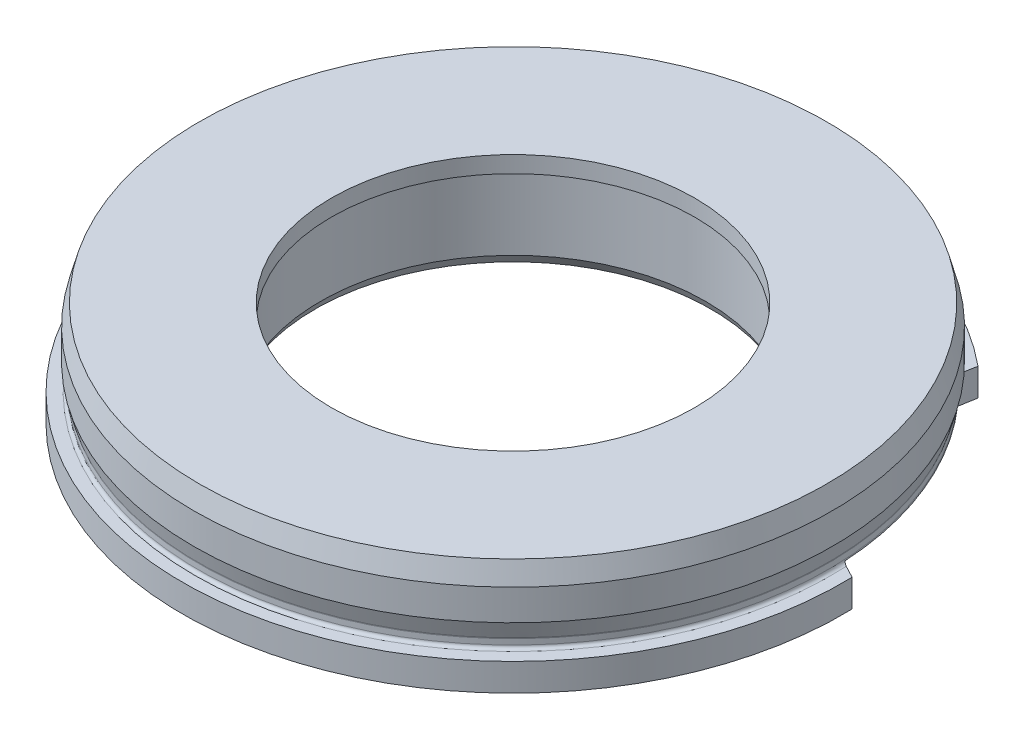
ISO-10303-21;
HEADER;
FILE_DESCRIPTION(('STEP AP214'),'2;1');
FILE_NAME('part.step','',(''),(''),'','','');
FILE_SCHEMA(('AUTOMOTIVE_DESIGN { 1 0 10303 214 1 1 1 1 }'));
ENDSEC;
DATA;
#1=APPLICATION_CONTEXT('core data for automotive mechanical design processes');
#2=APPLICATION_PROTOCOL_DEFINITION('international standard','automotive_design',2000,#1);
#3=PRODUCT_CONTEXT('',#1,'mechanical');
#4=PRODUCT('Part','Part','',(#3));
#5=PRODUCT_RELATED_PRODUCT_CATEGORY('part','',(#4));
#6=PRODUCT_DEFINITION_FORMATION('','',#4);
#7=PRODUCT_DEFINITION_CONTEXT('part definition',#1,'design');
#8=PRODUCT_DEFINITION('design','',#6,#7);
#9=PRODUCT_DEFINITION_SHAPE('','',#8);
#10=(LENGTH_UNIT() NAMED_UNIT(*) SI_UNIT(.MILLI.,.METRE.));
#11=(NAMED_UNIT(*) PLANE_ANGLE_UNIT() SI_UNIT($,.RADIAN.));
#12=(NAMED_UNIT(*) SI_UNIT($,.STERADIAN.) SOLID_ANGLE_UNIT());
#13=UNCERTAINTY_MEASURE_WITH_UNIT(LENGTH_MEASURE(1.E-05),#10,'distance_accuracy_value','');
#14=(GEOMETRIC_REPRESENTATION_CONTEXT(3) GLOBAL_UNCERTAINTY_ASSIGNED_CONTEXT((#13)) GLOBAL_UNIT_ASSIGNED_CONTEXT((#10,
#11,#12)) REPRESENTATION_CONTEXT('',''));
#15=CARTESIAN_POINT('',(0.,0.,0.));
#16=DIRECTION('',(0.,0.,1.));
#17=DIRECTION('',(1.,0.,0.));
#18=AXIS2_PLACEMENT_3D('',#15,#16,#17);
#19=CARTESIAN_POINT('',(0.,0.,0.));
#20=DIRECTION('',(0.,1.,0.));
#21=DIRECTION('',(0.,0.,1.));
#22=AXIS2_PLACEMENT_3D('',#19,#20,#21);
#23=PLANE('',#22);
#24=CARTESIAN_POINT('',(38.6481439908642,0.,-18.8499593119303));
#25=DIRECTION('',(0.,1.,0.));
#26=DIRECTION('',(1.,0.,0.));
#27=AXIS2_PLACEMENT_3D('',#24,#25,#26);
#28=CIRCLE('',#27,20.);
#29=CARTESIAN_POINT('',(28.8657979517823,0.,-1.4055990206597));
#30=VERTEX_POINT('',#29);
#31=CARTESIAN_POINT('',(29.9887421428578,0.,-0.821793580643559));
#32=VERTEX_POINT('',#31);
#33=EDGE_CURVE('E86',#30,#32,#28,.T.);
#34=ORIENTED_EDGE('',*,*,#33,.F.);
#35=CARTESIAN_POINT('',(0.,0.,0.));
#36=DIRECTION('',(0.,-1.,0.));
#37=DIRECTION('',(0.,0.,-1.));
#38=AXIS2_PLACEMENT_3D('',#35,#36,#37);
#39=CIRCLE('',#38,28.9);
#40=CARTESIAN_POINT('',(-28.8657979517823,0.,-1.4055990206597));
#41=VERTEX_POINT('',#40);
#42=EDGE_CURVE('E81',#30,#41,#39,.T.);
#43=ORIENTED_EDGE('',*,*,#42,.T.);
#44=CARTESIAN_POINT('',(-38.6481439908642,0.,-18.8499593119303));
#45=DIRECTION('',(0.,1.,0.));
#46=DIRECTION('',(-1.,0.,0.));
#47=AXIS2_PLACEMENT_3D('',#44,#45,#46);
#48=CIRCLE('',#47,20.);
#49=CARTESIAN_POINT('',(-29.9887421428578,0.,-0.821793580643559));
#50=VERTEX_POINT('',#49);
#51=EDGE_CURVE('E83',#50,#41,#48,.T.);
#52=ORIENTED_EDGE('',*,*,#51,.F.);
#53=CARTESIAN_POINT('',(0.,0.,0.));
#54=DIRECTION('',(0.,1.,0.));
#55=DIRECTION('',(1.,0.,0.));
#56=AXIS2_PLACEMENT_3D('',#53,#54,#55);
#57=CIRCLE('',#56,30.);
#58=EDGE_CURVE('E211',#50,#32,#57,.T.);
#59=ORIENTED_EDGE('',*,*,#58,.T.);
#60=EDGE_LOOP('',(#34,#43,#52,#59));
#61=FACE_BOUND('',#60,.T.);
#62=ADVANCED_FACE('F14',(#61),#23,.T.);
#63=CARTESIAN_POINT('',(0.,-2.5,0.));
#64=DIRECTION('',(0.,1.,0.));
#65=DIRECTION('',(0.,0.,1.));
#66=AXIS2_PLACEMENT_3D('',#63,#64,#65);
#67=CYLINDRICAL_SURFACE('',#66,30.);
#68=DIRECTION('',(0.,1.,0.));
#69=VECTOR('',#68,1.);
#70=CARTESIAN_POINT('',(-29.9887421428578,-56.3228646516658,-0.821793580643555));
#71=LINE('',#70,#69);
#72=CARTESIAN_POINT('',(-29.9887421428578,-2.5,-0.821793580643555));
#73=VERTEX_POINT('',#72);
#74=EDGE_CURVE('E98',#73,#50,#71,.T.);
#75=ORIENTED_EDGE('',*,*,#74,.F.);
#76=CARTESIAN_POINT('',(0.,-2.5,0.));
#77=DIRECTION('',(0.,1.,0.));
#78=DIRECTION('',(1.,0.,0.));
#79=AXIS2_PLACEMENT_3D('',#76,#77,#78);
#80=CIRCLE('',#79,30.);
#81=CARTESIAN_POINT('',(29.9887421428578,-2.5,-0.821793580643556));
#82=VERTEX_POINT('',#81);
#83=EDGE_CURVE('E37',#73,#82,#80,.T.);
#84=ORIENTED_EDGE('',*,*,#83,.T.);
#85=DIRECTION('',(0.,1.,0.));
#86=VECTOR('',#85,1.);
#87=CARTESIAN_POINT('',(29.9887421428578,-56.3228646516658,-0.821793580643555));
#88=LINE('',#87,#86);
#89=EDGE_CURVE('E221',#32,#82,#88,.F.);
#90=ORIENTED_EDGE('',*,*,#89,.F.);
#91=ORIENTED_EDGE('',*,*,#58,.F.);
#92=EDGE_LOOP('',(#75,#84,#90,#91));
#93=FACE_BOUND('',#92,.T.);
#94=ADVANCED_FACE('F138',(#93),#67,.T.);
#95=CARTESIAN_POINT('',(0.,7.,0.));
#96=DIRECTION('',(0.,-1.,0.));
#97=DIRECTION('',(0.,0.,-1.));
#98=AXIS2_PLACEMENT_3D('',#95,#96,#97);
#99=CYLINDRICAL_SURFACE('',#98,29.);
#100=CARTESIAN_POINT('',(0.,2.33231607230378,0.));
#101=DIRECTION('',(0.,-1.,0.));
#102=DIRECTION('',(0.,0.,-1.));
#103=AXIS2_PLACEMENT_3D('',#100,#101,#102);
#104=CIRCLE('',#103,29.);
#105=CARTESIAN_POINT('',(0.,2.33231607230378,-29.));
#106=VERTEX_POINT('',#105);
#107=EDGE_CURVE('E261',#106,#106,#104,.T.);
#108=ORIENTED_EDGE('',*,*,#107,.F.);
#109=EDGE_LOOP('',(#108));
#110=FACE_BOUND('',#109,.T.);
#111=CARTESIAN_POINT('',(0.,5.13397459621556,0.));
#112=DIRECTION('',(0.,1.,0.));
#113=DIRECTION('',(0.,0.,1.));
#114=AXIS2_PLACEMENT_3D('',#111,#112,#113);
#115=CIRCLE('',#114,29.);
#116=CARTESIAN_POINT('',(0.,5.13397459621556,29.));
#117=VERTEX_POINT('',#116);
#118=EDGE_CURVE('E230',#117,#117,#115,.F.);
#119=ORIENTED_EDGE('',*,*,#118,.T.);
#120=EDGE_LOOP('',(#119));
#121=FACE_BOUND('',#120,.T.);
#122=ADVANCED_FACE('F147',(#110,#121),#99,.T.);
#123=CARTESIAN_POINT('',(0.,7.,0.));
#124=DIRECTION('',(0.,1.,0.));
#125=DIRECTION('',(0.,0.,1.));
#126=AXIS2_PLACEMENT_3D('',#123,#124,#125);
#127=PLANE('',#126);
#128=CARTESIAN_POINT('',(0.,7.,0.));
#129=DIRECTION('',(0.,1.,0.));
#130=DIRECTION('',(0.,0.,1.));
#131=AXIS2_PLACEMENT_3D('',#128,#129,#130);
#132=CIRCLE('',#131,28.5);
#133=CARTESIAN_POINT('',(0.,7.,28.5));
#134=VERTEX_POINT('',#133);
#135=EDGE_CURVE('E226',#134,#134,#132,.T.);
#136=ORIENTED_EDGE('',*,*,#135,.T.);
#137=EDGE_LOOP('',(#136));
#138=FACE_BOUND('',#137,.T.);
#139=CARTESIAN_POINT('',(0.,7.00000000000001,0.));
#140=DIRECTION('',(0.,1.,0.));
#141=DIRECTION('',(0.,0.,1.));
#142=AXIS2_PLACEMENT_3D('',#139,#140,#141);
#143=CIRCLE('',#142,16.5);
#144=CARTESIAN_POINT('',(0.,7.00000000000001,16.5));
#145=VERTEX_POINT('',#144);
#146=EDGE_CURVE('E208',#145,#145,#143,.F.);
#147=ORIENTED_EDGE('',*,*,#146,.T.);
#148=EDGE_LOOP('',(#147));
#149=FACE_BOUND('',#148,.T.);
#150=ADVANCED_FACE('F150',(#138,#149),#127,.T.);
#151=CARTESIAN_POINT('',(0.,5.5,0.));
#152=DIRECTION('',(0.,1.,0.));
#153=DIRECTION('',(0.,0.,1.));
#154=AXIS2_PLACEMENT_3D('',#151,#152,#153);
#155=PLANE('',#154);
#156=CARTESIAN_POINT('',(0.,5.5,0.));
#157=DIRECTION('',(0.,1.,0.));
#158=DIRECTION('',(0.,0.,1.));
#159=AXIS2_PLACEMENT_3D('',#156,#157,#158);
#160=CIRCLE('',#159,17.1);
#161=CARTESIAN_POINT('',(0.,5.5,17.1));
#162=VERTEX_POINT('',#161);
#163=EDGE_CURVE('E9',#162,#162,#160,.F.);
#164=ORIENTED_EDGE('',*,*,#163,.T.);
#165=EDGE_LOOP('',(#164));
#166=FACE_BOUND('',#165,.T.);
#167=CARTESIAN_POINT('',(0.,5.50000000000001,0.));
#168=DIRECTION('',(0.,1.,0.));
#169=DIRECTION('',(0.,0.,1.));
#170=AXIS2_PLACEMENT_3D('',#167,#168,#169);
#171=CIRCLE('',#170,16.5);
#172=CARTESIAN_POINT('',(0.,5.50000000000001,16.5));
#173=VERTEX_POINT('',#172);
#174=EDGE_CURVE('E207',#173,#173,#171,.F.);
#175=ORIENTED_EDGE('',*,*,#174,.F.);
#176=EDGE_LOOP('',(#175));
#177=FACE_BOUND('',#176,.T.);
#178=ADVANCED_FACE('F142',(#166,#177),#155,.F.);
#179=CARTESIAN_POINT('',(0.,-2.5,0.));
#180=DIRECTION('',(0.,1.,0.));
#181=DIRECTION('',(0.,0.,1.));
#182=AXIS2_PLACEMENT_3D('',#179,#180,#181);
#183=PLANE('',#182);
#184=CARTESIAN_POINT('',(0.,-2.5,0.));
#185=DIRECTION('',(0.,1.,0.));
#186=DIRECTION('',(0.,0.,1.));
#187=AXIS2_PLACEMENT_3D('',#184,#185,#186);
#188=CIRCLE('',#187,18.);
#189=CARTESIAN_POINT('',(0.,-2.5,18.));
#190=VERTEX_POINT('',#189);
#191=EDGE_CURVE('E232',#190,#190,#188,.T.);
#192=ORIENTED_EDGE('',*,*,#191,.T.);
#193=EDGE_LOOP('',(#192));
#194=FACE_BOUND('',#193,.T.);
#195=ORIENTED_EDGE('',*,*,#83,.F.);
#196=CARTESIAN_POINT('',(-38.6481439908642,-2.5,-18.8499593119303));
#197=DIRECTION('',(0.,1.,0.));
#198=DIRECTION('',(0.,0.,1.));
#199=AXIS2_PLACEMENT_3D('',#196,#197,#198);
#200=CIRCLE('',#199,20.);
#201=CARTESIAN_POINT('',(-19.1104954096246,-2.5,-23.1255046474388));
#202=VERTEX_POINT('',#201);
#203=EDGE_CURVE('E100',#73,#202,#200,.T.);
#204=ORIENTED_EDGE('',*,*,#203,.T.);
#205=CARTESIAN_POINT('',(19.1104954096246,-2.5,-23.1255046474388));
#206=VERTEX_POINT('',#205);
#207=EDGE_CURVE('E218',#206,#202,#80,.T.);
#208=ORIENTED_EDGE('',*,*,#207,.F.);
#209=CARTESIAN_POINT('',(38.6481439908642,-2.5,-18.8499593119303));
#210=DIRECTION('',(0.,1.,0.));
#211=DIRECTION('',(0.,0.,1.));
#212=AXIS2_PLACEMENT_3D('',#209,#210,#211);
#213=CIRCLE('',#212,20.);
#214=EDGE_CURVE('E201',#206,#82,#213,.T.);
#215=ORIENTED_EDGE('',*,*,#214,.T.);
#216=EDGE_LOOP('',(#195,#204,#208,#215));
#217=FACE_BOUND('',#216,.T.);
#218=ADVANCED_FACE('F139',(#194,#217),#183,.F.);
#219=CARTESIAN_POINT('',(-18.8791868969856,0.,-21.8811860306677));
#220=VERTEX_POINT('',#219);
#221=CARTESIAN_POINT('',(-19.1104954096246,0.,-23.1255046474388));
#222=VERTEX_POINT('',#221);
#223=EDGE_CURVE('E101',#220,#222,#48,.T.);
#224=ORIENTED_EDGE('',*,*,#223,.F.);
#225=CARTESIAN_POINT('',(18.8791868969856,0.,-21.8811860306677));
#226=VERTEX_POINT('',#225);
#227=EDGE_CURVE('E90',#220,#226,#39,.T.);
#228=ORIENTED_EDGE('',*,*,#227,.T.);
#229=CARTESIAN_POINT('',(19.1104954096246,0.,-23.1255046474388));
#230=VERTEX_POINT('',#229);
#231=EDGE_CURVE('E198',#230,#226,#28,.T.);
#232=ORIENTED_EDGE('',*,*,#231,.F.);
#233=EDGE_CURVE('E214',#230,#222,#57,.T.);
#234=ORIENTED_EDGE('',*,*,#233,.T.);
#235=EDGE_LOOP('',(#224,#228,#232,#234));
#236=FACE_BOUND('',#235,.T.);
#237=ADVANCED_FACE('F136',(#236),#23,.T.);
#238=DIRECTION('',(0.,1.,0.));
#239=VECTOR('',#238,1.);
#240=CARTESIAN_POINT('',(-19.1104954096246,-56.3228646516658,-23.1255046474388));
#241=LINE('',#240,#239);
#242=EDGE_CURVE('E29',#222,#202,#241,.F.);
#243=ORIENTED_EDGE('',*,*,#242,.F.);
#244=ORIENTED_EDGE('',*,*,#233,.F.);
#245=DIRECTION('',(0.,1.,0.));
#246=VECTOR('',#245,1.);
#247=CARTESIAN_POINT('',(19.1104954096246,-56.3228646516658,-23.1255046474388));
#248=LINE('',#247,#246);
#249=EDGE_CURVE('E222',#206,#230,#248,.T.);
#250=ORIENTED_EDGE('',*,*,#249,.F.);
#251=ORIENTED_EDGE('',*,*,#207,.T.);
#252=EDGE_LOOP('',(#243,#244,#250,#251));
#253=FACE_BOUND('',#252,.T.);
#254=ADVANCED_FACE('F132',(#253),#67,.T.);
#255=CARTESIAN_POINT('',(0.,5.5,0.));
#256=DIRECTION('',(0.,-1.,0.));
#257=DIRECTION('',(0.,0.,-1.));
#258=AXIS2_PLACEMENT_3D('',#255,#256,#257);
#259=CYLINDRICAL_SURFACE('',#258,17.5);
#260=CARTESIAN_POINT('',(0.,5.1,0.));
#261=DIRECTION('',(0.,1.,0.));
#262=DIRECTION('',(0.,0.,1.));
#263=AXIS2_PLACEMENT_3D('',#260,#261,#262);
#264=CIRCLE('',#263,17.5);
#265=CARTESIAN_POINT('',(0.,5.1,17.5));
#266=VERTEX_POINT('',#265);
#267=EDGE_CURVE('E22',#266,#266,#264,.T.);
#268=ORIENTED_EDGE('',*,*,#267,.T.);
#269=EDGE_LOOP('',(#268));
#270=FACE_BOUND('',#269,.T.);
#271=CARTESIAN_POINT('',(0.,-1.63397459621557,0.));
#272=DIRECTION('',(0.,1.,0.));
#273=DIRECTION('',(0.,0.,1.));
#274=AXIS2_PLACEMENT_3D('',#271,#272,#273);
#275=CIRCLE('',#274,17.5);
#276=CARTESIAN_POINT('',(0.,-1.63397459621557,17.5));
#277=VERTEX_POINT('',#276);
#278=EDGE_CURVE('E110',#277,#277,#275,.F.);
#279=ORIENTED_EDGE('',*,*,#278,.T.);
#280=EDGE_LOOP('',(#279));
#281=FACE_BOUND('',#280,.T.);
#282=ADVANCED_FACE('F135',(#270,#281),#259,.F.);
#283=CARTESIAN_POINT('',(0.,82.8829608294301,0.));
#284=DIRECTION('',(0.,-1.,0.));
#285=DIRECTION('',(0.,0.,-1.));
#286=AXIS2_PLACEMENT_3D('',#283,#284,#285);
#287=CYLINDRICAL_SURFACE('',#286,16.5);
#288=ORIENTED_EDGE('',*,*,#174,.T.);
#289=EDGE_LOOP('',(#288));
#290=FACE_BOUND('',#289,.T.);
#291=ORIENTED_EDGE('',*,*,#146,.F.);
#292=EDGE_LOOP('',(#291));
#293=FACE_BOUND('',#292,.T.);
#294=ADVANCED_FACE('F130',(#290,#293),#287,.F.);
#295=CARTESIAN_POINT('',(38.6481439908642,0.2,-18.8499593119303));
#296=DIRECTION('',(0.,-1.,0.));
#297=DIRECTION('',(0.,0.,-1.));
#298=AXIS2_PLACEMENT_3D('',#295,#296,#297);
#299=CYLINDRICAL_SURFACE('',#298,20.);
#300=ORIENTED_EDGE('',*,*,#231,.T.);
#301=CARTESIAN_POINT('',(18.831010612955,0.200200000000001,-21.5483337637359));
#302=CARTESIAN_POINT('',(18.8319090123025,0.184405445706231,-21.5549315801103));
#303=CARTESIAN_POINT('',(18.833014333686,0.169307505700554,-21.5630250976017));
#304=CARTESIAN_POINT('',(18.8355728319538,0.140859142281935,-21.5816458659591));
#305=CARTESIAN_POINT('',(18.8370237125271,0.127498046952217,-21.5921570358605));
#306=CARTESIAN_POINT('',(18.8402147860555,0.102710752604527,-21.6151128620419));
#307=CARTESIAN_POINT('',(18.8419539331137,0.0912778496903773,-21.6275505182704));
#308=CARTESIAN_POINT('',(18.845676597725,0.0703712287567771,-21.6539677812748));
#309=CARTESIAN_POINT('',(18.8476605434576,0.0609010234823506,-21.6679500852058));
#310=CARTESIAN_POINT('',(18.8520948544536,0.0428975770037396,-21.6989439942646));
#311=CARTESIAN_POINT('',(18.8545723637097,0.0346434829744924,-21.7161135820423));
#312=CARTESIAN_POINT('',(18.8597203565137,0.0207453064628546,-21.7514433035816));
#313=CARTESIAN_POINT('',(18.8623908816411,0.0151017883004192,-21.7696036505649));
#314=CARTESIAN_POINT('',(18.868273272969,0.00579684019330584,-21.8092109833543));
#315=CARTESIAN_POINT('',(18.8715073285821,0.0025438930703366,-21.8307513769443));
#316=CARTESIAN_POINT('',(18.8780843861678,-0.000514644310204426,-21.8740664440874));
#317=CARTESIAN_POINT('',(18.8814274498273,-0.000318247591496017,-21.8958412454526));
#318=CARTESIAN_POINT('',(18.8883609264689,0.00368496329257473,-21.940512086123));
#319=CARTESIAN_POINT('',(18.8919531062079,0.00772913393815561,-21.9633873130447));
#320=CARTESIAN_POINT('',(18.8990500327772,0.0198273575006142,-22.0080916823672));
#321=CARTESIAN_POINT('',(18.9025547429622,0.027883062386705,-22.029920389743));
#322=CARTESIAN_POINT('',(18.909177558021,0.0475681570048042,-22.0707687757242));
#323=CARTESIAN_POINT('',(18.9123059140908,0.0590232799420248,-22.0898700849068));
#324=CARTESIAN_POINT('',(18.9181794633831,0.0854859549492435,-22.125447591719));
#325=CARTESIAN_POINT('',(18.9209259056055,0.100481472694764,-22.1419323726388));
#326=CARTESIAN_POINT('',(18.9252037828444,0.12932360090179,-22.1674510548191));
#327=CARTESIAN_POINT('',(18.9268645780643,0.142428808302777,-22.1773031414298));
#328=CARTESIAN_POINT('',(18.9298123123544,0.170209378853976,-22.1947273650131));
#329=CARTESIAN_POINT('',(18.9310971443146,0.184892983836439,-22.2022866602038));
#330=CARTESIAN_POINT('',(18.9321502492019,0.200199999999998,-22.2084695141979));
#331=B_SPLINE_CURVE_WITH_KNOTS('',3,(#301,#302,#303,#304,#305,#306,#307,#308,#309,#310,#311,
#312,#313,#314,#315,#316,#317,#318,#319,#320,#321,#322,#323,#324,#325,#326,#327,#328,#329,#330),
.UNSPECIFIED.,.F.,.F.,(4,2,2,2,2,2,2,2,2,2,2,2,2,2,4),(0.,0.0512642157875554,0.10219683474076,
0.152948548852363,0.203790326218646,0.261200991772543,0.318624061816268,0.384411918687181,
0.450237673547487,0.520406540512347,0.590604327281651,0.657690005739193,0.72455085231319,
0.77376451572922,0.823248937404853),.UNSPECIFIED.);
#332=CARTESIAN_POINT('',(18.8310220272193,0.2,-21.5484175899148));
#333=VERTEX_POINT('',#332);
#334=EDGE_CURVE('E189',#333,#226,#331,.T.);
#335=ORIENTED_EDGE('',*,*,#334,.F.);
#336=CARTESIAN_POINT('',(38.6481439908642,0.2,-18.8499593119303));
#337=DIRECTION('',(0.,1.,0.));
#338=DIRECTION('',(1.,0.,0.));
#339=AXIS2_PLACEMENT_3D('',#336,#337,#338);
#340=CIRCLE('',#339,20.);
#341=CARTESIAN_POINT('',(28.5739195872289,0.2,-1.57251729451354));
#342=VERTEX_POINT('',#341);
#343=EDGE_CURVE('E204',#333,#342,#340,.T.);
#344=ORIENTED_EDGE('',*,*,#343,.T.);
#345=CARTESIAN_POINT('',(28.9001999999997,0.00186873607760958,-1.38635178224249));
#346=CARTESIAN_POINT('',(28.8780310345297,-0.00054528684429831,-1.39872340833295));
#347=CARTESIAN_POINT('',(28.8556827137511,-0.00061657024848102,-1.4112559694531));
#348=CARTESIAN_POINT('',(28.8112831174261,0.00390935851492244,-1.43626371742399));
#349=CARTESIAN_POINT('',(28.7892339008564,0.00853004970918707,-1.44873829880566));
#350=CARTESIAN_POINT('',(28.7481732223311,0.0218478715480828,-1.47206834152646));
#351=CARTESIAN_POINT('',(28.7290636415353,0.0301599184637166,-1.48297074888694));
#352=CARTESIAN_POINT('',(28.6925407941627,0.0506676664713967,-1.50388183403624));
#353=CARTESIAN_POINT('',(28.675123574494,0.0628540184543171,-1.5138925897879));
#354=CARTESIAN_POINT('',(28.6468144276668,0.0874927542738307,-1.53021320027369));
#355=CARTESIAN_POINT('',(28.6353773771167,0.0991239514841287,-1.53682402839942));
#356=CARTESIAN_POINT('',(28.6143368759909,0.124389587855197,-1.54900957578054));
#357=CARTESIAN_POINT('',(28.6047287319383,0.138018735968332,-1.55458694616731));
#358=CARTESIAN_POINT('',(28.5918769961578,0.160027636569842,-1.56205833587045));
#359=CARTESIAN_POINT('',(28.5877987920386,0.167768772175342,-1.56443144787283));
#360=CARTESIAN_POINT('',(28.5803076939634,0.183677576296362,-1.56879352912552));
#361=CARTESIAN_POINT('',(28.576895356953,0.191845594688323,-1.5707821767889));
#362=CARTESIAN_POINT('',(28.5738465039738,0.200199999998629,-1.57255990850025));
#363=B_SPLINE_CURVE_WITH_KNOTS('',3,(#345,#346,#347,#348,#349,#350,#351,#352,#353,#354,#355,
#356,#357,#358,#359,#360,#361,#362),.UNSPECIFIED.,.F.,.F.,(4,2,2,2,2,2,2,2,4),(0.,
0.0764252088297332,0.153234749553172,0.223433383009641,0.293463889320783,0.346063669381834,
0.39852658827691,0.425686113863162,0.452868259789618),.UNSPECIFIED.);
#364=EDGE_CURVE('E183',#30,#342,#363,.T.);
#365=ORIENTED_EDGE('',*,*,#364,.F.);
#366=ORIENTED_EDGE('',*,*,#33,.T.);
#367=ORIENTED_EDGE('',*,*,#89,.T.);
#368=ORIENTED_EDGE('',*,*,#214,.F.);
#369=ORIENTED_EDGE('',*,*,#249,.T.);
#370=EDGE_LOOP('',(#300,#335,#344,#365,#366,#367,#368,#369));
#371=FACE_BOUND('',#370,.T.);
#372=ADVANCED_FACE('F125',(#371),#299,.F.);
#373=CARTESIAN_POINT('',(38.6481439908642,0.2,-18.8499593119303));
#374=DIRECTION('',(0.,1.,0.));
#375=DIRECTION('',(0.,0.,1.));
#376=AXIS2_PLACEMENT_3D('',#373,#374,#375);
#377=PLANE('',#376);
#378=ORIENTED_EDGE('',*,*,#343,.F.);
#379=CARTESIAN_POINT('',(0.,0.2,0.));
#380=DIRECTION('',(0.,-1.,0.));
#381=DIRECTION('',(0.,0.,-1.));
#382=AXIS2_PLACEMENT_3D('',#379,#380,#381);
#383=CIRCLE('',#382,28.6171572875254);
#384=EDGE_CURVE('E250',#333,#342,#383,.T.);
#385=ORIENTED_EDGE('',*,*,#384,.T.);
#386=EDGE_LOOP('',(#378,#385));
#387=FACE_BOUND('',#386,.T.);
#388=ADVANCED_FACE('F129',(#387),#377,.F.);
#389=CARTESIAN_POINT('',(-38.6481439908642,0.2,-18.8499593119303));
#390=DIRECTION('',(0.,1.,0.));
#391=DIRECTION('',(0.,0.,1.));
#392=AXIS2_PLACEMENT_3D('',#389,#390,#391);
#393=PLANE('',#392);
#394=CARTESIAN_POINT('',(-38.6481439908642,0.2,-18.8499593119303));
#395=DIRECTION('',(0.,1.,0.));
#396=DIRECTION('',(-1.,0.,0.));
#397=AXIS2_PLACEMENT_3D('',#394,#395,#396);
#398=CIRCLE('',#397,20.);
#399=CARTESIAN_POINT('',(-28.5739195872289,0.2,-1.57251729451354));
#400=VERTEX_POINT('',#399);
#401=CARTESIAN_POINT('',(-18.831022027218,0.200000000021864,-21.5484175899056));
#402=VERTEX_POINT('',#401);
#403=EDGE_CURVE('E196',#400,#402,#398,.T.);
#404=ORIENTED_EDGE('',*,*,#403,.F.);
#405=CARTESIAN_POINT('',(0.,0.2,0.));
#406=DIRECTION('',(0.,-1.,0.));
#407=DIRECTION('',(0.,0.,-1.));
#408=AXIS2_PLACEMENT_3D('',#405,#406,#407);
#409=CIRCLE('',#408,28.6171572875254);
#410=EDGE_CURVE('E106',#400,#402,#409,.T.);
#411=ORIENTED_EDGE('',*,*,#410,.T.);
#412=EDGE_LOOP('',(#404,#411));
#413=FACE_BOUND('',#412,.T.);
#414=ADVANCED_FACE('F124',(#413),#393,.F.);
#415=CARTESIAN_POINT('',(-38.6481439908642,0.2,-18.8499593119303));
#416=DIRECTION('',(0.,-1.,0.));
#417=DIRECTION('',(0.,0.,-1.));
#418=AXIS2_PLACEMENT_3D('',#415,#416,#417);
#419=CYLINDRICAL_SURFACE('',#418,20.);
#420=ORIENTED_EDGE('',*,*,#51,.T.);
#421=CARTESIAN_POINT('',(-28.5738465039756,0.200200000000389,-1.57255990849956));
#422=CARTESIAN_POINT('',(-28.5795986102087,0.184405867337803,-1.56920592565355));
#423=CARTESIAN_POINT('',(-28.5866566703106,0.169308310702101,-1.56509419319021));
#424=CARTESIAN_POINT('',(-28.6029050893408,0.140859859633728,-1.55564629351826));
#425=CARTESIAN_POINT('',(-28.6120814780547,0.127498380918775,-1.55031815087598));
#426=CARTESIAN_POINT('',(-28.6321363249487,0.102710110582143,-1.53869927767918));
#427=CARTESIAN_POINT('',(-28.6430086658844,0.0912766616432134,-1.53241200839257));
#428=CARTESIAN_POINT('',(-28.6661177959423,0.0703702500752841,-1.51908133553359));
#429=CARTESIAN_POINT('',(-28.6783568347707,0.060900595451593,-1.51203668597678));
#430=CARTESIAN_POINT('',(-28.7055065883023,0.0428996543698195,-1.496451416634));
#431=CARTESIAN_POINT('',(-28.7205582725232,0.0346470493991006,-1.48783505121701));
#432=CARTESIAN_POINT('',(-28.7515674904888,0.0207478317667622,-1.47014073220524));
#433=CARTESIAN_POINT('',(-28.7675256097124,0.0151029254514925,-1.46106248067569));
#434=CARTESIAN_POINT('',(-28.8027624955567,0.00568957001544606,-1.44108412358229));
#435=CARTESIAN_POINT('',(-28.8221443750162,0.00240363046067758,-1.43013678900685));
#436=CARTESIAN_POINT('',(-28.8611299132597,-0.000564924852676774,-1.40820278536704));
#437=CARTESIAN_POINT('',(-28.8807332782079,-0.00025185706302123,-1.39721617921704));
#438=CARTESIAN_POINT('',(-28.9001999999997,0.00186873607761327,-1.38635178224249));
#439=B_SPLINE_CURVE_WITH_KNOTS('',3,(#421,#422,#423,#424,#425,#426,#427,#428,#429,#430,#431,
#432,#433,#434,#435,#436,#437,#438),.UNSPECIFIED.,.F.,.F.,(4,2,2,2,2,2,2,2,4),(0.,
0.0512628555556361,0.102196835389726,0.152951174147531,0.203790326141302,0.261188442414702,
0.318624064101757,0.385829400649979,0.452954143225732),.UNSPECIFIED.);
#440=EDGE_CURVE('E96',#400,#41,#439,.T.);
#441=ORIENTED_EDGE('',*,*,#440,.F.);
#442=ORIENTED_EDGE('',*,*,#403,.T.);
#443=CARTESIAN_POINT('',(-18.9321502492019,0.2002,-22.2084695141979));
#444=CARTESIAN_POINT('',(-18.9310698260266,0.184486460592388,-22.2021265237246));
#445=CARTESIAN_POINT('',(-18.9297440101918,0.169427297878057,-22.1943256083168));
#446=CARTESIAN_POINT('',(-18.926696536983,0.140992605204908,-22.176307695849));
#447=CARTESIAN_POINT('',(-18.9249772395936,0.127607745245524,-22.1661050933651));
#448=CARTESIAN_POINT('',(-18.9212283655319,0.102740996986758,-22.1437303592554));
#449=CARTESIAN_POINT('',(-18.9191996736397,0.0912538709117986,-22.1315638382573));
#450=CARTESIAN_POINT('',(-18.9149067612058,0.070253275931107,-22.1056499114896));
#451=CARTESIAN_POINT('',(-18.9126421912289,0.0607427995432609,-22.0919001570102));
#452=CARTESIAN_POINT('',(-18.9076983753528,0.042864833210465,-22.0616668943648));
#453=CARTESIAN_POINT('',(-18.9050007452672,0.034731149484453,-22.0450484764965));
#454=CARTESIAN_POINT('',(-18.899491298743,0.0210104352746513,-22.0108164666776));
#455=CARTESIAN_POINT('',(-18.8966794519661,0.0154240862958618,-21.9932026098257));
#456=CARTESIAN_POINT('',(-18.8906097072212,0.00617386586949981,-21.954837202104));
#457=CARTESIAN_POINT('',(-18.8873449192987,0.00289314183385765,-21.9339939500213));
#458=CARTESIAN_POINT('',(-18.8808434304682,-0.000401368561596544,-21.8920441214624));
#459=CARTESIAN_POINT('',(-18.8776067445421,-0.000413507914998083,-21.8709374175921));
#460=CARTESIAN_POINT('',(-18.8709529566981,0.00294910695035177,-21.8270801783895));
#461=CARTESIAN_POINT('',(-18.867545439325,0.00662542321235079,-21.8043505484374));
#462=CARTESIAN_POINT('',(-18.8609417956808,0.0178170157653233,-21.7597938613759));
#463=CARTESIAN_POINT('',(-18.8577458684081,0.0253358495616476,-21.7379676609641));
#464=CARTESIAN_POINT('',(-18.8516914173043,0.044116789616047,-21.6961686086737));
#465=CARTESIAN_POINT('',(-18.8488300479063,0.0553436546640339,-21.6761804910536));
#466=CARTESIAN_POINT('',(-18.8435248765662,0.0814624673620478,-21.6387614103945));
#467=CARTESIAN_POINT('',(-18.84107956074,0.0963406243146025,-21.6213212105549));
#468=CARTESIAN_POINT('',(-18.8372388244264,0.125599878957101,-21.5937128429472));
#469=CARTESIAN_POINT('',(-18.8357319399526,0.139262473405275,-21.5828008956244));
#470=CARTESIAN_POINT('',(-18.8330791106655,0.168426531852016,-21.56349928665));
#471=CARTESIAN_POINT('',(-18.8319357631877,0.183940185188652,-21.5551277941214));
#472=CARTESIAN_POINT('',(-18.831010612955,0.200199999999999,-21.5483337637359));
#473=B_SPLINE_CURVE_WITH_KNOTS('',3,(#443,#444,#445,#446,#447,#448,#449,#450,#451,#452,#453,
#454,#455,#456,#457,#458,#459,#460,#461,#462,#463,#464,#465,#466,#467,#468,#469,#470,#471,#472),
.UNSPECIFIED.,.F.,.F.,(4,2,2,2,2,2,2,2,2,2,2,2,2,2,4),(0.,0.0507997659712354,0.101302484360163,
0.151663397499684,0.202100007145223,0.257974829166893,0.313864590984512,0.377651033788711,
0.441469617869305,0.510968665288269,0.58053217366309,0.649452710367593,0.718116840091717,
0.770501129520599,0.823251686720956),.UNSPECIFIED.);
#474=EDGE_CURVE('E107',#220,#402,#473,.T.);
#475=ORIENTED_EDGE('',*,*,#474,.F.);
#476=ORIENTED_EDGE('',*,*,#223,.T.);
#477=ORIENTED_EDGE('',*,*,#242,.T.);
#478=ORIENTED_EDGE('',*,*,#203,.F.);
#479=ORIENTED_EDGE('',*,*,#74,.T.);
#480=EDGE_LOOP('',(#420,#441,#442,#475,#476,#477,#478,#479));
#481=FACE_BOUND('',#480,.T.);
#482=ADVANCED_FACE('F94',(#481),#419,.F.);
#483=CARTESIAN_POINT('',(0.,7.,0.));
#484=DIRECTION('',(0.,-1.,0.));
#485=DIRECTION('',(0.,0.,-1.));
#486=AXIS2_PLACEMENT_3D('',#483,#484,#485);
#487=CONICAL_SURFACE('',#486,28.5,0.26179938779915);
#488=ORIENTED_EDGE('',*,*,#118,.F.);
#489=EDGE_LOOP('',(#488));
#490=FACE_BOUND('',#489,.T.);
#491=ORIENTED_EDGE('',*,*,#135,.F.);
#492=EDGE_LOOP('',(#491));
#493=FACE_BOUND('',#492,.T.);
#494=ADVANCED_FACE('F123',(#490,#493),#487,.T.);
#495=CARTESIAN_POINT('',(0.,-2.5,0.));
#496=DIRECTION('',(0.,-1.,0.));
#497=DIRECTION('',(0.,0.,-1.));
#498=AXIS2_PLACEMENT_3D('',#495,#496,#497);
#499=CONICAL_SURFACE('',#498,18.,0.523598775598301);
#500=ORIENTED_EDGE('',*,*,#278,.F.);
#501=EDGE_LOOP('',(#500));
#502=FACE_BOUND('',#501,.T.);
#503=ORIENTED_EDGE('',*,*,#191,.F.);
#504=EDGE_LOOP('',(#503));
#505=FACE_BOUND('',#504,.T.);
#506=ADVANCED_FACE('F172',(#502,#505),#499,.F.);
#507=CARTESIAN_POINT('',(0.,0.300000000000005,0.));
#508=DIRECTION('',(0.,-1.,0.));
#509=DIRECTION('',(0.,0.,-1.));
#510=AXIS2_PLACEMENT_3D('',#507,#508,#509);
#511=TOROIDAL_SURFACE('',#510,28.9,0.3);
#512=ORIENTED_EDGE('',*,*,#440,.T.);
#513=ORIENTED_EDGE('',*,*,#42,.F.);
#514=ORIENTED_EDGE('',*,*,#364,.T.);
#515=ORIENTED_EDGE('',*,*,#384,.F.);
#516=ORIENTED_EDGE('',*,*,#334,.T.);
#517=ORIENTED_EDGE('',*,*,#227,.F.);
#518=ORIENTED_EDGE('',*,*,#474,.T.);
#519=ORIENTED_EDGE('',*,*,#410,.F.);
#520=EDGE_LOOP('',(#512,#513,#514,#515,#516,#517,#518,#519));
#521=FACE_BOUND('',#520,.T.);
#522=CARTESIAN_POINT('',(0.,0.300000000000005,0.));
#523=DIRECTION('',(0.,-1.,0.));
#524=DIRECTION('',(0.,0.,-1.));
#525=AXIS2_PLACEMENT_3D('',#522,#523,#524);
#526=CIRCLE('',#525,28.6);
#527=CARTESIAN_POINT('',(0.,0.300000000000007,-28.6));
#528=VERTEX_POINT('',#527);
#529=EDGE_CURVE('E91',#528,#528,#526,.T.);
#530=ORIENTED_EDGE('',*,*,#529,.T.);
#531=EDGE_LOOP('',(#530));
#532=FACE_BOUND('',#531,.T.);
#533=ADVANCED_FACE('F103',(#521,#532),#511,.F.);
#534=CARTESIAN_POINT('',(0.,-25.,0.));
#535=DIRECTION('',(0.,-1.,0.));
#536=DIRECTION('',(0.,0.,-1.));
#537=AXIS2_PLACEMENT_3D('',#534,#535,#536);
#538=CYLINDRICAL_SURFACE('',#537,28.6);
#539=ORIENTED_EDGE('',*,*,#529,.F.);
#540=EDGE_LOOP('',(#539));
#541=FACE_BOUND('',#540,.T.);
#542=CARTESIAN_POINT('',(0.,0.800000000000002,0.));
#543=DIRECTION('',(0.,-1.,0.));
#544=DIRECTION('',(0.,0.,-1.));
#545=AXIS2_PLACEMENT_3D('',#542,#543,#544);
#546=CIRCLE('',#545,28.6);
#547=CARTESIAN_POINT('',(0.,0.800000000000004,-28.6));
#548=VERTEX_POINT('',#547);
#549=EDGE_CURVE('E255',#548,#548,#546,.T.);
#550=ORIENTED_EDGE('',*,*,#549,.T.);
#551=EDGE_LOOP('',(#550));
#552=FACE_BOUND('',#551,.T.);
#553=ADVANCED_FACE('F285',(#541,#552),#538,.T.);
#554=CARTESIAN_POINT('',(0.,0.800000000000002,0.));
#555=DIRECTION('',(0.,-1.,0.));
#556=DIRECTION('',(0.,0.,-1.));
#557=AXIS2_PLACEMENT_3D('',#554,#555,#556);
#558=TOROIDAL_SURFACE('',#557,28.9,0.3);
#559=ORIENTED_EDGE('',*,*,#549,.F.);
#560=EDGE_LOOP('',(#559));
#561=FACE_BOUND('',#560,.T.);
#562=CARTESIAN_POINT('',(0.,0.877645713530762,0.));
#563=DIRECTION('',(0.,-1.,0.));
#564=DIRECTION('',(0.,0.,-1.));
#565=AXIS2_PLACEMENT_3D('',#562,#563,#564);
#566=CIRCLE('',#565,28.6102222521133);
#567=CARTESIAN_POINT('',(0.,0.877645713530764,-28.6102222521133));
#568=VERTEX_POINT('',#567);
#569=EDGE_CURVE('E258',#568,#568,#566,.T.);
#570=ORIENTED_EDGE('',*,*,#569,.T.);
#571=EDGE_LOOP('',(#570));
#572=FACE_BOUND('',#571,.T.);
#573=ADVANCED_FACE('F275',(#561,#572),#558,.F.);
#574=CARTESIAN_POINT('',(0.,2.33231607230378,0.));
#575=DIRECTION('',(0.,1.,0.));
#576=DIRECTION('',(0.,0.,1.));
#577=AXIS2_PLACEMENT_3D('',#574,#575,#576);
#578=CONICAL_SURFACE('',#577,29.,0.261799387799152);
#579=ORIENTED_EDGE('',*,*,#569,.F.);
#580=EDGE_LOOP('',(#579));
#581=FACE_BOUND('',#580,.T.);
#582=ORIENTED_EDGE('',*,*,#107,.T.);
#583=EDGE_LOOP('',(#582));
#584=FACE_BOUND('',#583,.T.);
#585=ADVANCED_FACE('F265',(#581,#584),#578,.T.);
#586=CARTESIAN_POINT('',(0.,5.1,0.));
#587=DIRECTION('',(0.,1.,0.));
#588=DIRECTION('',(0.,0.,1.));
#589=AXIS2_PLACEMENT_3D('',#586,#587,#588);
#590=TOROIDAL_SURFACE('',#589,17.1,0.4);
#591=ORIENTED_EDGE('',*,*,#163,.F.);
#592=EDGE_LOOP('',(#591));
#593=FACE_BOUND('',#592,.T.);
#594=ORIENTED_EDGE('',*,*,#267,.F.);
#595=EDGE_LOOP('',(#594));
#596=FACE_BOUND('',#595,.T.);
#597=ADVANCED_FACE('F274',(#593,#596),#590,.F.);
#598=CLOSED_SHELL('',(#62,#94,#122,#150,#178,#218,#237,#254,#282,#294,#372,#388,#414,#482,#494,
#506,#533,#553,#573,#585,#597));
#599=MANIFOLD_SOLID_BREP('B1',#598);
#600=ADVANCED_BREP_SHAPE_REPRESENTATION('',(#18,#599),#14);
#601=SHAPE_DEFINITION_REPRESENTATION(#9,#600);
ENDSEC;
END-ISO-10303-21;
